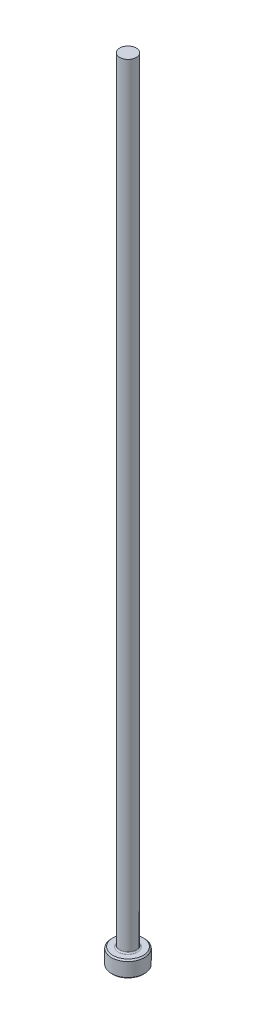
ISO-10303-21;
HEADER;
FILE_DESCRIPTION(('STEP AP214'),'2;1');
FILE_NAME('part.step','',(''),(''),'','','');
FILE_SCHEMA(('AUTOMOTIVE_DESIGN { 1 0 10303 214 1 1 1 1 }'));
ENDSEC;
DATA;
#1=APPLICATION_CONTEXT('core data for automotive mechanical design processes');
#2=APPLICATION_PROTOCOL_DEFINITION('international standard','automotive_design',2000,#1);
#3=PRODUCT_CONTEXT('',#1,'mechanical');
#4=PRODUCT('Part','Part','',(#3));
#5=PRODUCT_RELATED_PRODUCT_CATEGORY('part','',(#4));
#6=PRODUCT_DEFINITION_FORMATION('','',#4);
#7=PRODUCT_DEFINITION_CONTEXT('part definition',#1,'design');
#8=PRODUCT_DEFINITION('design','',#6,#7);
#9=PRODUCT_DEFINITION_SHAPE('','',#8);
#10=(LENGTH_UNIT() NAMED_UNIT(*) SI_UNIT(.MILLI.,.METRE.));
#11=(NAMED_UNIT(*) PLANE_ANGLE_UNIT() SI_UNIT($,.RADIAN.));
#12=(NAMED_UNIT(*) SI_UNIT($,.STERADIAN.) SOLID_ANGLE_UNIT());
#13=UNCERTAINTY_MEASURE_WITH_UNIT(LENGTH_MEASURE(1.E-05),#10,'distance_accuracy_value','');
#14=(GEOMETRIC_REPRESENTATION_CONTEXT(3) GLOBAL_UNCERTAINTY_ASSIGNED_CONTEXT((#13)) GLOBAL_UNIT_ASSIGNED_CONTEXT((#10,
#11,#12)) REPRESENTATION_CONTEXT('',''));
#15=CARTESIAN_POINT('',(0.,0.,0.));
#16=DIRECTION('',(0.,0.,1.));
#17=DIRECTION('',(1.,0.,0.));
#18=AXIS2_PLACEMENT_3D('',#15,#16,#17);
#19=CARTESIAN_POINT('',(0.,0.,0.));
#20=DIRECTION('',(0.,-1.,0.));
#21=DIRECTION('',(0.,0.,-1.));
#22=AXIS2_PLACEMENT_3D('',#19,#20,#21);
#23=PLANE('',#22);
#24=CARTESIAN_POINT('',(0.,0.,0.));
#25=DIRECTION('',(0.,-1.,0.));
#26=DIRECTION('',(0.,0.,-1.));
#27=AXIS2_PLACEMENT_3D('',#24,#25,#26);
#28=CIRCLE('',#27,2.92099999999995);
#29=CARTESIAN_POINT('',(0.,0.,-2.92099999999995));
#30=VERTEX_POINT('',#29);
#31=EDGE_CURVE('E46',#30,#30,#28,.T.);
#32=ORIENTED_EDGE('',*,*,#31,.T.);
#33=EDGE_LOOP('',(#32));
#34=FACE_BOUND('',#33,.T.);
#35=ADVANCED_FACE('F35',(#34),#23,.T.);
#36=CARTESIAN_POINT('',(0.,259.958771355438,0.));
#37=DIRECTION('',(0.,1.,0.));
#38=DIRECTION('',(0.,0.,1.));
#39=AXIS2_PLACEMENT_3D('',#36,#37,#38);
#40=CYLINDRICAL_SURFACE('',#39,3.17499999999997);
#41=CARTESIAN_POINT('',(0.,2.92099999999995,0.));
#42=DIRECTION('',(0.,1.,0.));
#43=DIRECTION('',(0.,0.,1.));
#44=AXIS2_PLACEMENT_3D('',#41,#42,#43);
#45=CIRCLE('',#44,3.17499999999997);
#46=CARTESIAN_POINT('',(0.,2.92099999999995,3.17499999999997));
#47=VERTEX_POINT('',#46);
#48=EDGE_CURVE('E50',#47,#47,#45,.F.);
#49=ORIENTED_EDGE('',*,*,#48,.T.);
#50=EDGE_LOOP('',(#49));
#51=FACE_BOUND('',#50,.T.);
#52=CARTESIAN_POINT('',(0.,0.254000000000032,0.));
#53=DIRECTION('',(0.,-1.,0.));
#54=DIRECTION('',(0.,0.,-1.));
#55=AXIS2_PLACEMENT_3D('',#52,#53,#54);
#56=CIRCLE('',#55,3.17499999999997);
#57=CARTESIAN_POINT('',(0.,0.254000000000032,-3.17499999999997));
#58=VERTEX_POINT('',#57);
#59=EDGE_CURVE('E55',#58,#58,#56,.F.);
#60=ORIENTED_EDGE('',*,*,#59,.T.);
#61=EDGE_LOOP('',(#60));
#62=FACE_BOUND('',#61,.T.);
#63=ADVANCED_FACE('F77',(#51,#62),#40,.T.);
#64=CARTESIAN_POINT('',(-3.17499999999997,3.175,0.));
#65=DIRECTION('',(0.,1.,0.));
#66=DIRECTION('',(0.,0.,1.));
#67=AXIS2_PLACEMENT_3D('',#64,#65,#66);
#68=PLANE('',#67);
#69=CARTESIAN_POINT('',(0.,3.175,0.));
#70=DIRECTION('',(0.,1.,0.));
#71=DIRECTION('',(0.,0.,1.));
#72=AXIS2_PLACEMENT_3D('',#69,#70,#71);
#73=CIRCLE('',#72,1.84149999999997);
#74=CARTESIAN_POINT('',(0.,3.175,1.84149999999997));
#75=VERTEX_POINT('',#74);
#76=EDGE_CURVE('E10',#75,#75,#73,.F.);
#77=ORIENTED_EDGE('',*,*,#76,.T.);
#78=EDGE_LOOP('',(#77));
#79=FACE_BOUND('',#78,.T.);
#80=CARTESIAN_POINT('',(0.,3.175,0.));
#81=DIRECTION('',(0.,1.,0.));
#82=DIRECTION('',(0.,0.,1.));
#83=AXIS2_PLACEMENT_3D('',#80,#81,#82);
#84=CIRCLE('',#83,2.92099999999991);
#85=CARTESIAN_POINT('',(0.,3.175,2.92099999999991));
#86=VERTEX_POINT('',#85);
#87=EDGE_CURVE('E58',#86,#86,#84,.T.);
#88=ORIENTED_EDGE('',*,*,#87,.T.);
#89=EDGE_LOOP('',(#88));
#90=FACE_BOUND('',#89,.T.);
#91=ADVANCED_FACE('F69',(#79,#90),#68,.T.);
#92=CARTESIAN_POINT('',(0.,259.958771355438,0.));
#93=DIRECTION('',(0.,1.,0.));
#94=DIRECTION('',(0.,0.,1.));
#95=AXIS2_PLACEMENT_3D('',#92,#93,#94);
#96=CYLINDRICAL_SURFACE('',#95,1.58749999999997);
#97=CARTESIAN_POINT('',(0.,3.42900000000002,0.));
#98=DIRECTION('',(0.,1.,0.));
#99=DIRECTION('',(0.,0.,1.));
#100=AXIS2_PLACEMENT_3D('',#97,#98,#99);
#101=CIRCLE('',#100,1.58749999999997);
#102=CARTESIAN_POINT('',(0.,3.42900000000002,1.58749999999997));
#103=VERTEX_POINT('',#102);
#104=EDGE_CURVE('E42',#103,#103,#101,.T.);
#105=ORIENTED_EDGE('',*,*,#104,.T.);
#106=EDGE_LOOP('',(#105));
#107=FACE_BOUND('',#106,.T.);
#108=CARTESIAN_POINT('',(0.,152.4,0.));
#109=DIRECTION('',(0.,1.,0.));
#110=DIRECTION('',(0.,0.,1.));
#111=AXIS2_PLACEMENT_3D('',#108,#109,#110);
#112=CIRCLE('',#111,1.58749999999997);
#113=CARTESIAN_POINT('',(0.,152.4,1.58749999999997));
#114=VERTEX_POINT('',#113);
#115=EDGE_CURVE('E61',#114,#114,#112,.T.);
#116=ORIENTED_EDGE('',*,*,#115,.F.);
#117=EDGE_LOOP('',(#116));
#118=FACE_BOUND('',#117,.T.);
#119=ADVANCED_FACE('F67',(#107,#118),#96,.T.);
#120=CARTESIAN_POINT('',(-1.58749999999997,152.4,0.));
#121=DIRECTION('',(0.,1.,0.));
#122=DIRECTION('',(0.,0.,1.));
#123=AXIS2_PLACEMENT_3D('',#120,#121,#122);
#124=PLANE('',#123);
#125=ORIENTED_EDGE('',*,*,#115,.T.);
#126=EDGE_LOOP('',(#125));
#127=FACE_BOUND('',#126,.T.);
#128=ADVANCED_FACE('F65',(#127),#124,.T.);
#129=CARTESIAN_POINT('',(0.,3.17499999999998,0.));
#130=DIRECTION('',(0.,-1.,0.));
#131=DIRECTION('',(0.,0.,-1.));
#132=AXIS2_PLACEMENT_3D('',#129,#130,#131);
#133=CONICAL_SURFACE('',#132,2.92099999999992,0.785398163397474);
#134=ORIENTED_EDGE('',*,*,#48,.F.);
#135=EDGE_LOOP('',(#134));
#136=FACE_BOUND('',#135,.T.);
#137=ORIENTED_EDGE('',*,*,#87,.F.);
#138=EDGE_LOOP('',(#137));
#139=FACE_BOUND('',#138,.T.);
#140=ADVANCED_FACE('F75',(#136,#139),#133,.T.);
#141=CARTESIAN_POINT('',(0.,0.254000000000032,0.));
#142=DIRECTION('',(0.,1.,0.));
#143=DIRECTION('',(0.,0.,1.));
#144=AXIS2_PLACEMENT_3D('',#141,#142,#143);
#145=CONICAL_SURFACE('',#144,3.17499999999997,0.785398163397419);
#146=ORIENTED_EDGE('',*,*,#31,.F.);
#147=EDGE_LOOP('',(#146));
#148=FACE_BOUND('',#147,.T.);
#149=ORIENTED_EDGE('',*,*,#59,.F.);
#150=EDGE_LOOP('',(#149));
#151=FACE_BOUND('',#150,.T.);
#152=ADVANCED_FACE('F89',(#148,#151),#145,.T.);
#153=CARTESIAN_POINT('',(0.,3.42900000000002,0.));
#154=DIRECTION('',(0.,1.,0.));
#155=DIRECTION('',(0.,0.,1.));
#156=AXIS2_PLACEMENT_3D('',#153,#154,#155);
#157=TOROIDAL_SURFACE('',#156,1.84149999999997,0.254);
#158=ORIENTED_EDGE('',*,*,#76,.F.);
#159=EDGE_LOOP('',(#158));
#160=FACE_BOUND('',#159,.T.);
#161=ORIENTED_EDGE('',*,*,#104,.F.);
#162=EDGE_LOOP('',(#161));
#163=FACE_BOUND('',#162,.T.);
#164=ADVANCED_FACE('F37',(#160,#163),#157,.F.);
#165=CLOSED_SHELL('',(#35,#63,#91,#119,#128,#140,#152,#164));
#166=MANIFOLD_SOLID_BREP('B2',#165);
#167=ADVANCED_BREP_SHAPE_REPRESENTATION('',(#18,#166),#14);
#168=SHAPE_DEFINITION_REPRESENTATION(#9,#167);
ENDSEC;
END-ISO-10303-21;
